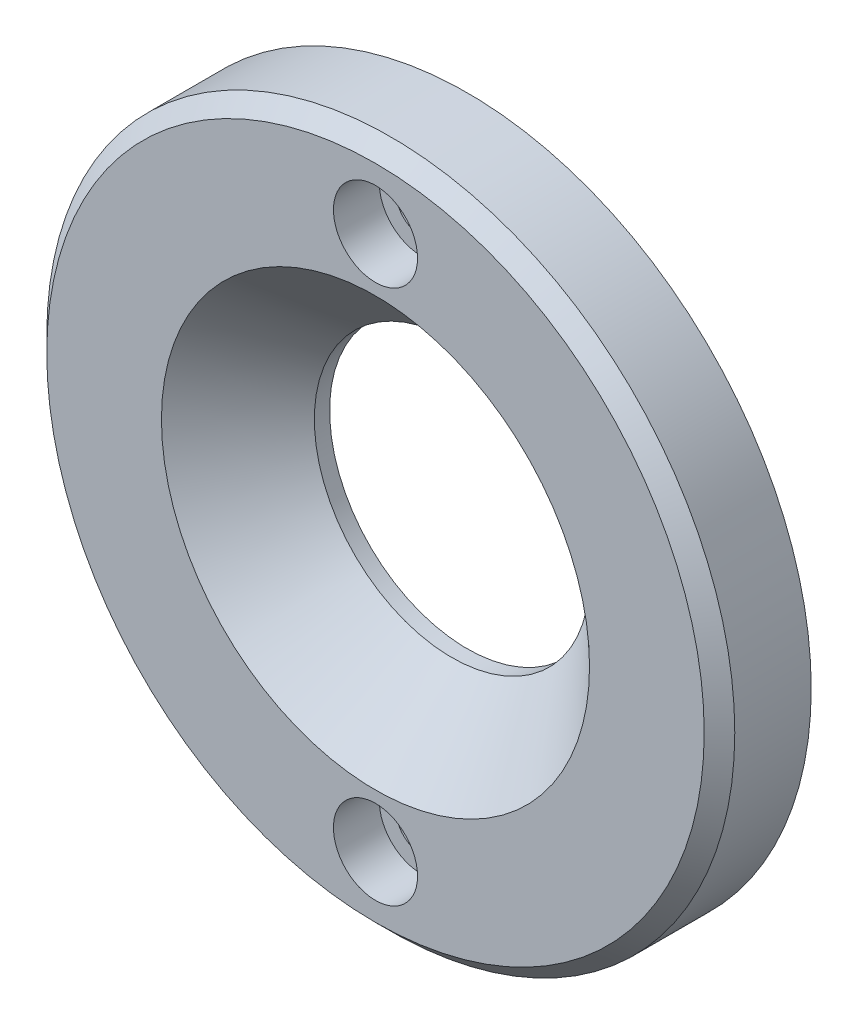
from build123d import *

# Parameters (mm, degrees)
ESQUISSE1_R                                        = 45
EXTRUSION1_DEPTH                                   = 12
CHANFREIN1_SIZE                                    = 2
ESQUISSE2_R                                        = 18
ENL_V_MAT_EXTRU_1_DEPTH                            = 65.761099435
CHANFREIN2_SIZE                                    = 10
CHAMBRAGE_POUR_VIS_T_TE_HEXAGONALE_M61_D           = 6.6
CHAMBRAGE_POUR_VIS_T_TE_HEXAGONALE_M61_CBORE_D     = 11
CHAMBRAGE_POUR_VIS_T_TE_HEXAGONALE_M61_CBORE_DEPTH = 6


with BuildPart() as part:
    # Esquisse1 → Extrusion1 (new body)
    with BuildSketch(Plane.XY):
        Circle(ESQUISSE1_R)
    extrude(amount=EXTRUSION1_DEPTH)

    # Chanfrein1
    chanfrein1_edges = [part.edges().sort_by_distance(p)[0] for p in [
        (-45, 0, 12),
    ]]
    chamfer(chanfrein1_edges, length=CHANFREIN1_SIZE)

    # Esquisse2 → Enl_v. mat.-Extru.1 (cut, through all)
    with BuildSketch(Plane.XY.offset(12)):
        Circle(ESQUISSE2_R)
    extrude(amount=-ENL_V_MAT_EXTRU_1_DEPTH, mode=Mode.SUBTRACT)

    # Chanfrein2
    chanfrein2_edges = [part.edges().sort_by_distance(p)[0] for p in [
        (-18, 0, 12),
    ]]
    chamfer(chanfrein2_edges, length=CHANFREIN2_SIZE)

    # Chambrage pour vis _ t_te hexagonale M61 (through all)
    with Locations(Plane.XY.offset(12)):
        with Locations((0, 35), (0, -35)):
            CounterBoreHole(CHAMBRAGE_POUR_VIS_T_TE_HEXAGONALE_M61_D / 2, CHAMBRAGE_POUR_VIS_T_TE_HEXAGONALE_M61_CBORE_D / 2, CHAMBRAGE_POUR_VIS_T_TE_HEXAGONALE_M61_CBORE_DEPTH)


solid = part.part
